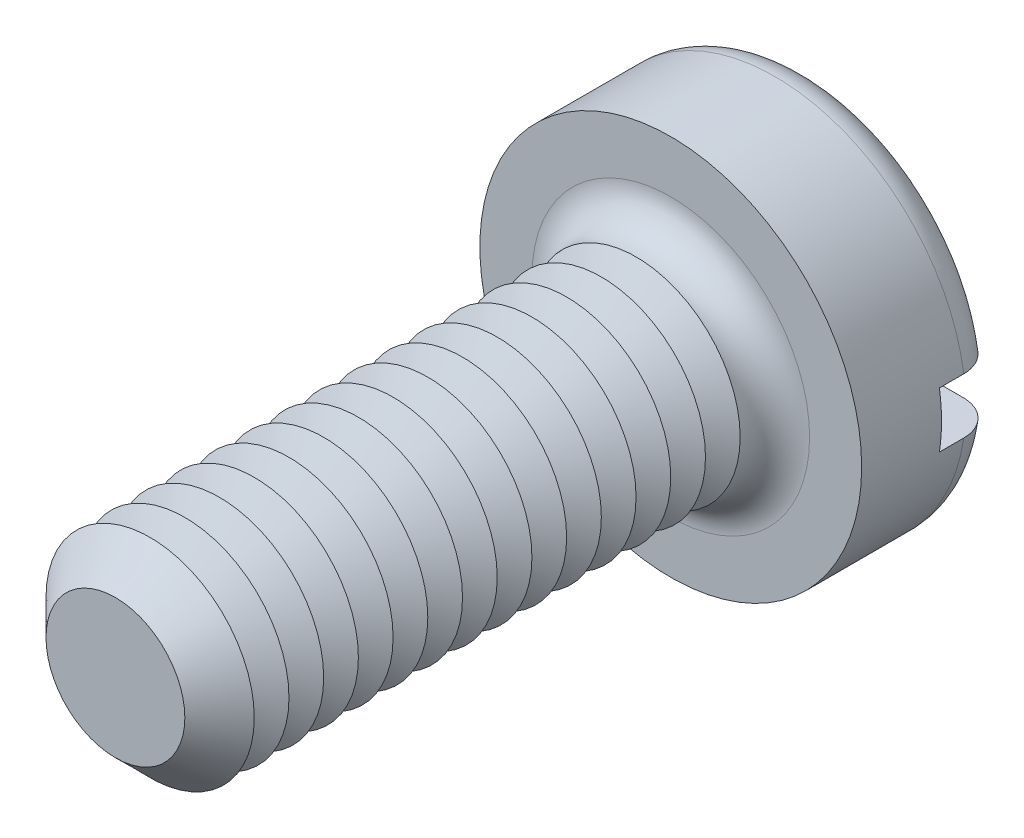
ISO-10303-21;
HEADER;
FILE_DESCRIPTION(('STEP AP214'),'2;1');
FILE_NAME('part.step','',(''),(''),'','','');
FILE_SCHEMA(('AUTOMOTIVE_DESIGN { 1 0 10303 214 1 1 1 1 }'));
ENDSEC;
DATA;
#1=APPLICATION_CONTEXT('core data for automotive mechanical design processes');
#2=APPLICATION_PROTOCOL_DEFINITION('international standard','automotive_design',2000,#1);
#3=PRODUCT_CONTEXT('',#1,'mechanical');
#4=PRODUCT('Part','Part','',(#3));
#5=PRODUCT_RELATED_PRODUCT_CATEGORY('part','',(#4));
#6=PRODUCT_DEFINITION_FORMATION('','',#4);
#7=PRODUCT_DEFINITION_CONTEXT('part definition',#1,'design');
#8=PRODUCT_DEFINITION('design','',#6,#7);
#9=PRODUCT_DEFINITION_SHAPE('','',#8);
#10=(LENGTH_UNIT() NAMED_UNIT(*) SI_UNIT(.MILLI.,.METRE.));
#11=(NAMED_UNIT(*) PLANE_ANGLE_UNIT() SI_UNIT($,.RADIAN.));
#12=(NAMED_UNIT(*) SI_UNIT($,.STERADIAN.) SOLID_ANGLE_UNIT());
#13=UNCERTAINTY_MEASURE_WITH_UNIT(LENGTH_MEASURE(1.E-05),#10,'distance_accuracy_value','');
#14=(GEOMETRIC_REPRESENTATION_CONTEXT(3) GLOBAL_UNCERTAINTY_ASSIGNED_CONTEXT((#13)) GLOBAL_UNIT_ASSIGNED_CONTEXT((#10,
#11,#12)) REPRESENTATION_CONTEXT('',''));
#15=CARTESIAN_POINT('',(0.,0.,0.));
#16=DIRECTION('',(0.,0.,1.));
#17=DIRECTION('',(1.,0.,0.));
#18=AXIS2_PLACEMENT_3D('',#15,#16,#17);
#19=CARTESIAN_POINT('',(0.,0.,-2.));
#20=DIRECTION('',(0.,0.,1.));
#21=DIRECTION('',(1.,0.,0.));
#22=AXIS2_PLACEMENT_3D('',#19,#20,#21);
#23=PLANE('',#22);
#24=CARTESIAN_POINT('',(0.,0.,-2.));
#25=DIRECTION('',(0.,0.,1.));
#26=DIRECTION('',(1.,0.,0.));
#27=AXIS2_PLACEMENT_3D('',#24,#25,#26);
#28=CIRCLE('',#27,2.25);
#29=CARTESIAN_POINT('',(-2.21415898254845,0.4,-2.));
#30=VERTEX_POINT('',#29);
#31=CARTESIAN_POINT('',(2.21415898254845,0.4,-2.));
#32=VERTEX_POINT('',#31);
#33=EDGE_CURVE('E116',#30,#32,#28,.F.);
#34=ORIENTED_EDGE('',*,*,#33,.T.);
#35=DIRECTION('',(1.,0.,0.));
#36=VECTOR('',#35,1.);
#37=CARTESIAN_POINT('',(-2.75,0.400000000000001,-2.));
#38=LINE('',#37,#36);
#39=EDGE_CURVE('E111',#30,#32,#38,.T.);
#40=ORIENTED_EDGE('',*,*,#39,.F.);
#41=EDGE_LOOP('',(#34,#40));
#42=FACE_BOUND('',#41,.T.);
#43=ADVANCED_FACE('F39',(#42),#23,.F.);
#44=CARTESIAN_POINT('',(0.,0.,-1.5));
#45=DIRECTION('',(0.,0.,1.));
#46=DIRECTION('',(1.,0.,0.));
#47=AXIS2_PLACEMENT_3D('',#44,#45,#46);
#48=TOROIDAL_SURFACE('',#47,2.25,0.5);
#49=CARTESIAN_POINT('',(-2.6296588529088,0.400000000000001,-1.78631483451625));
#50=CARTESIAN_POINT('',(-2.61332846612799,0.400000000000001,-1.80942627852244));
#51=CARTESIAN_POINT('',(-2.59501593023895,0.400000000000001,-1.83116426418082));
#52=CARTESIAN_POINT('',(-2.55497423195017,0.400000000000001,-1.87126271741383));
#53=CARTESIAN_POINT('',(-2.53324055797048,0.4,-1.88961865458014));
#54=CARTESIAN_POINT('',(-2.48702796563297,0.4,-1.92241505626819));
#55=CARTESIAN_POINT('',(-2.46255183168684,0.4,-1.93685944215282));
#56=CARTESIAN_POINT('',(-2.41154731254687,0.4,-1.96147315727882));
#57=CARTESIAN_POINT('',(-2.38501943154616,0.4,-1.97164353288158));
#58=CARTESIAN_POINT('',(-2.3303912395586,0.4,-1.98753780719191));
#59=CARTESIAN_POINT('',(-2.30227842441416,0.4,-1.99321871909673));
#60=CARTESIAN_POINT('',(-2.24549884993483,0.4,-1.99984170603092));
#61=CARTESIAN_POINT('',(-2.21683202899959,0.4,-2.00078325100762));
#62=CARTESIAN_POINT('',(-2.15939326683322,0.4,-1.99790249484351));
#63=CARTESIAN_POINT('',(-2.13062419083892,0.4,-1.99402290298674));
#64=CARTESIAN_POINT('',(-2.07413526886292,0.4,-1.98151915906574));
#65=CARTESIAN_POINT('',(-2.04641547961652,0.4,-1.97289475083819));
#66=CARTESIAN_POINT('',(-1.99264697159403,0.4,-1.95107177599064));
#67=CARTESIAN_POINT('',(-1.96660904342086,0.4,-1.93784659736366));
#68=CARTESIAN_POINT('',(-1.91713954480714,0.4,-1.90718730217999));
#69=CARTESIAN_POINT('',(-1.89370795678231,0.4,-1.88975321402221));
#70=CARTESIAN_POINT('',(-1.85029144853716,0.4,-1.85126548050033));
#71=CARTESIAN_POINT('',(-1.83028607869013,0.4,-1.83023492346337));
#72=CARTESIAN_POINT('',(-1.79417432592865,0.4,-1.78505552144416));
#73=CARTESIAN_POINT('',(-1.77806752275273,0.4,-1.76090701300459));
#74=CARTESIAN_POINT('',(-1.75056079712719,0.4,-1.71067721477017));
#75=CARTESIAN_POINT('',(-1.7390748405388,0.4,-1.68464306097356));
#76=CARTESIAN_POINT('',(-1.72075680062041,0.4,-1.63098625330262));
#77=CARTESIAN_POINT('',(-1.71392397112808,0.4,-1.60336385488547));
#78=CARTESIAN_POINT('',(-1.70525661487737,0.4,-1.54801066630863));
#79=CARTESIAN_POINT('',(-1.70330866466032,0.4,-1.52029759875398));
#80=CARTESIAN_POINT('',(-1.70414820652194,0.4,-1.46494458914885));
#81=CARTESIAN_POINT('',(-1.70693532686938,0.4,-1.43730464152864));
#82=CARTESIAN_POINT('',(-1.71709335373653,0.4,-1.38318389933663));
#83=CARTESIAN_POINT('',(-1.72441580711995,0.4,-1.35669397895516));
#84=CARTESIAN_POINT('',(-1.74335830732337,0.4,-1.30529964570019));
#85=CARTESIAN_POINT('',(-1.75497853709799,0.4,-1.2803953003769));
#86=CARTESIAN_POINT('',(-1.78229453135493,0.4,-1.23258298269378));
#87=CARTESIAN_POINT('',(-1.79803217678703,0.4,-1.20969896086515));
#88=CARTESIAN_POINT('',(-1.83304498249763,0.4,-1.16682064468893));
#89=CARTESIAN_POINT('',(-1.85232054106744,0.4,-1.1468266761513));
#90=CARTESIAN_POINT('',(-1.89433695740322,0.4,-1.10980713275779));
#91=CARTESIAN_POINT('',(-1.91714740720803,0.4,-1.09286053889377));
#92=CARTESIAN_POINT('',(-1.96524407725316,0.4,-1.06294809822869));
#93=CARTESIAN_POINT('',(-1.99053056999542,0.4,-1.04998269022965));
#94=CARTESIAN_POINT('',(-2.04340612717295,0.4,-1.02814800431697));
#95=CARTESIAN_POINT('',(-2.07103098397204,0.4,-1.01936532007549));
#96=CARTESIAN_POINT('',(-2.12735840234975,0.4,-1.00652373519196));
#97=CARTESIAN_POINT('',(-2.15606102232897,0.4,-1.00246509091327));
#98=CARTESIAN_POINT('',(-2.21395379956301,0.4,-0.999181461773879));
#99=CARTESIAN_POINT('',(-2.24314598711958,0.4,-0.999992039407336));
#100=CARTESIAN_POINT('',(-2.30097585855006,0.4,-1.00652779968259));
#101=CARTESIAN_POINT('',(-2.32961355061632,0.4,-1.01225290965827));
#102=CARTESIAN_POINT('',(-2.38536238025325,0.4,-1.02843951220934));
#103=CARTESIAN_POINT('',(-2.41248047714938,0.4,-1.03887701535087));
#104=CARTESIAN_POINT('',(-2.46454860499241,0.4,-1.06421009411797));
#105=CARTESIAN_POINT('',(-2.48949875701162,0.4,-1.0791054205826));
#106=CARTESIAN_POINT('',(-2.53620471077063,0.4,-1.11274531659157));
#107=CARTESIAN_POINT('',(-2.55799482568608,0.400000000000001,-1.1314422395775));
#108=CARTESIAN_POINT('',(-2.59807595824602,0.400000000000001,-1.17227176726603));
#109=CARTESIAN_POINT('',(-2.6163672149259,0.400000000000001,-1.19440413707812));
#110=CARTESIAN_POINT('',(-2.64868581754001,0.400000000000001,-1.24117072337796));
#111=CARTESIAN_POINT('',(-2.66276466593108,0.400000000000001,-1.26576935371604));
#112=CARTESIAN_POINT('',(-2.68654482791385,0.400000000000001,-1.31699754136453));
#113=CARTESIAN_POINT('',(-2.69624657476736,0.400000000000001,-1.34362689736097));
#114=CARTESIAN_POINT('',(-2.71090527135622,0.400000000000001,-1.39787706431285));
#115=CARTESIAN_POINT('',(-2.71590826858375,0.400000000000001,-1.4254854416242));
#116=CARTESIAN_POINT('',(-2.72118463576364,0.400000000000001,-1.48115803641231));
#117=CARTESIAN_POINT('',(-2.72145696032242,0.400000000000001,-1.50922235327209));
#118=CARTESIAN_POINT('',(-2.71727180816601,0.400000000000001,-1.56487271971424));
#119=CARTESIAN_POINT('',(-2.71283440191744,0.400000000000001,-1.59246029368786));
#120=CARTESIAN_POINT('',(-2.69939521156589,0.400000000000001,-1.64647499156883));
#121=CARTESIAN_POINT('',(-2.69039909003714,0.400000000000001,-1.67290351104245));
#122=CARTESIAN_POINT('',(-2.67251693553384,0.400000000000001,-1.71382731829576));
#123=CARTESIAN_POINT('',(-2.66497994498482,0.400000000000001,-1.72892686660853));
#124=CARTESIAN_POINT('',(-2.64841616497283,0.400000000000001,-1.75828509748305));
#125=CARTESIAN_POINT('',(-2.63938938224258,0.400000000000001,-1.77254378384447));
#126=CARTESIAN_POINT('',(-2.6296588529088,0.400000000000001,-1.78631483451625));
#127=B_SPLINE_CURVE_WITH_KNOTS('',3,(#49,#50,#51,#52,#53,#54,#55,#56,#57,#58,#59,#60,#61,#62,
#63,#64,#65,#66,#67,#68,#69,#70,#71,#72,#73,#74,#75,#76,#77,#78,#79,#80,#81,#82,#83,#84,#85,#86,
#87,#88,#89,#90,#91,#92,#93,#94,#95,#96,#97,#98,#99,#100,#101,#102,#103,#104,#105,#106,#107,
#108,#109,#110,#111,#112,#113,#114,#115,#116,#117,#118,#119,#120,#121,#122,#123,#124,#125,#126),
.UNSPECIFIED.,.T.,.F.,(4,2,2,2,2,2,2,2,2,2,2,2,2,2,2,2,2,2,2,2,2,2,2,2,2,2,2,2,2,2,2,2,2,2,2,2,
2,2,4),(0.,0.0848338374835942,0.16978050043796,0.254641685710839,0.339482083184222,
0.42512530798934,0.510778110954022,0.597458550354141,0.684143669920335,0.771338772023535,
0.858533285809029,0.945187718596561,1.03183280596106,1.11678035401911,1.20171427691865,
1.28465703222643,1.36759327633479,1.4496584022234,1.53172702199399,1.61466526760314,
1.69761285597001,1.78247103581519,1.86733856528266,1.95389396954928,2.0404540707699,
2.12764713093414,2.21483890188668,2.30159172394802,2.38833969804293,2.4740609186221,
2.55977628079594,2.6443962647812,2.72900787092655,2.81278135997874,2.89657336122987,
2.98000971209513,3.06334267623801,3.113891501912,3.16444009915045),.UNSPECIFIED.);
#128=CARTESIAN_POINT('',(-2.72075357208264,0.400000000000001,-1.50000000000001));
#129=VERTEX_POINT('',#128);
#130=EDGE_CURVE('E290',#129,#30,#127,.T.);
#131=ORIENTED_EDGE('',*,*,#130,.F.);
#132=CARTESIAN_POINT('',(0.,0.,-1.5));
#133=DIRECTION('',(0.,0.,1.));
#134=DIRECTION('',(1.,0.,0.));
#135=AXIS2_PLACEMENT_3D('',#132,#133,#134);
#136=CIRCLE('',#135,2.75);
#137=CARTESIAN_POINT('',(2.7207535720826,0.4,-1.5));
#138=VERTEX_POINT('',#137);
#139=EDGE_CURVE('E124',#138,#129,#136,.T.);
#140=ORIENTED_EDGE('',*,*,#139,.F.);
#141=CARTESIAN_POINT('',(1.7362507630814,0.4,-1.6752840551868));
#142=CARTESIAN_POINT('',(1.74636083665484,0.4,-1.70159961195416));
#143=CARTESIAN_POINT('',(1.7587429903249,0.4,-1.72706707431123));
#144=CARTESIAN_POINT('',(1.78764414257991,0.4,-1.77556609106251));
#145=CARTESIAN_POINT('',(1.80416918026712,0.4,-1.79859401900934));
#146=CARTESIAN_POINT('',(1.84080454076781,0.4,-1.84153587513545));
#147=CARTESIAN_POINT('',(1.86090949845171,0.4,-1.86145438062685));
#148=CARTESIAN_POINT('',(1.9041208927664,0.4,-1.89769607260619));
#149=CARTESIAN_POINT('',(1.92722659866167,0.4,-1.91402013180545));
#150=CARTESIAN_POINT('',(1.97620958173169,0.4,-1.94291288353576));
#151=CARTESIAN_POINT('',(2.00212726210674,0.4,-1.95541309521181));
#152=CARTESIAN_POINT('',(2.05567603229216,0.4,-1.97595143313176));
#153=CARTESIAN_POINT('',(2.08330733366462,0.4,-1.98398900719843));
#154=CARTESIAN_POINT('',(2.13989163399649,0.4,-1.99545904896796));
#155=CARTESIAN_POINT('',(2.16885726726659,0.4,-1.99882930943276));
#156=CARTESIAN_POINT('',(2.22694412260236,0.4,-2.00065872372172));
#157=CARTESIAN_POINT('',(2.25606534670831,0.4,-1.99911781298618));
#158=CARTESIAN_POINT('',(2.31362436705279,0.4,-1.99114818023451));
#159=CARTESIAN_POINT('',(2.34206235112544,0.4,-1.98472081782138));
#160=CARTESIAN_POINT('',(2.39743709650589,0.4,-1.96713601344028));
#161=CARTESIAN_POINT('',(2.42437392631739,0.4,-1.95597878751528));
#162=CARTESIAN_POINT('',(2.47569769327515,0.4,-1.92935960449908));
#163=CARTESIAN_POINT('',(2.50010686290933,0.4,-1.91394052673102));
#164=CARTESIAN_POINT('',(2.54594525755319,0.4,-1.8791725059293));
#165=CARTESIAN_POINT('',(2.56737468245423,0.4,-1.85982382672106));
#166=CARTESIAN_POINT('',(2.60634898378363,0.4,-1.81801641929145));
#167=CARTESIAN_POINT('',(2.6239407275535,0.4,-1.79560138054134));
#168=CARTESIAN_POINT('',(2.65505953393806,0.4,-1.7481077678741));
#169=CARTESIAN_POINT('',(2.66858686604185,0.4,-1.72302937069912));
#170=CARTESIAN_POINT('',(2.69103536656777,0.4,-1.67123055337));
#171=CARTESIAN_POINT('',(2.70000740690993,0.4,-1.64453217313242));
#172=CARTESIAN_POINT('',(2.71330608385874,0.4,-1.59000262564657));
#173=CARTESIAN_POINT('',(2.71763293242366,0.4,-1.5621715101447));
#174=CARTESIAN_POINT('',(2.72149675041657,0.4,-1.50637655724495));
#175=CARTESIAN_POINT('',(2.72106725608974,0.4,-1.47841503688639));
#176=CARTESIAN_POINT('',(2.7155123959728,0.4,-1.42296287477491));
#177=CARTESIAN_POINT('',(2.71038711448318,0.4,-1.39547222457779));
#178=CARTESIAN_POINT('',(2.69560462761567,0.4,-1.34178071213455));
#179=CARTESIAN_POINT('',(2.68595389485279,0.4,-1.31557806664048));
#180=CARTESIAN_POINT('',(2.66240876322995,0.4,-1.26515516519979));
#181=CARTESIAN_POINT('',(2.64851431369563,0.4,-1.24093493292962));
#182=CARTESIAN_POINT('',(2.61681930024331,0.4,-1.19504594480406));
#183=CARTESIAN_POINT('',(2.59900198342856,0.4,-1.17338876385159));
#184=CARTESIAN_POINT('',(2.56001495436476,0.4,-1.13333899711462));
#185=CARTESIAN_POINT('',(2.53884510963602,0.4,-1.11494654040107));
#186=CARTESIAN_POINT('',(2.49354554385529,0.4,-1.08175888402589));
#187=CARTESIAN_POINT('',(2.46938991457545,0.4,-1.06699905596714));
#188=CARTESIAN_POINT('',(2.41896725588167,0.4,-1.04168682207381));
#189=CARTESIAN_POINT('',(2.39270009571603,0.4,-1.03113467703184));
#190=CARTESIAN_POINT('',(2.33844927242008,0.4,-1.01439607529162));
#191=CARTESIAN_POINT('',(2.31044823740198,0.4,-1.00826592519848));
#192=CARTESIAN_POINT('',(2.25381752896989,0.4,-1.00073183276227));
#193=CARTESIAN_POINT('',(2.22518781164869,0.4,-0.999328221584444));
#194=CARTESIAN_POINT('',(2.16774231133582,0.4,-1.00127811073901));
#195=CARTESIAN_POINT('',(2.13892848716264,0.4,-1.00468955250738));
#196=CARTESIAN_POINT('',(2.08227193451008,0.4,-1.01626887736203));
#197=CARTESIAN_POINT('',(2.05442926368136,0.4,-1.02443704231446));
#198=CARTESIAN_POINT('',(2.00032604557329,0.4,-1.04537295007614));
#199=CARTESIAN_POINT('',(1.97407661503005,0.4,-1.05816944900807));
#200=CARTESIAN_POINT('',(1.92411255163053,0.4,-1.08801035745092));
#201=CARTESIAN_POINT('',(1.90039792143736,0.4,-1.10505477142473));
#202=CARTESIAN_POINT('',(1.85633574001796,0.4,-1.14282887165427));
#203=CARTESIAN_POINT('',(1.83597040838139,0.4,-1.16353779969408));
#204=CARTESIAN_POINT('',(1.79908731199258,0.4,-1.20813793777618));
#205=CARTESIAN_POINT('',(1.78256899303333,0.4,-1.23202868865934));
#206=CARTESIAN_POINT('',(1.75420022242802,0.4,-1.28183173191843));
#207=CARTESIAN_POINT('',(1.74226635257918,0.4,-1.30769648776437));
#208=CARTESIAN_POINT('',(1.72302798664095,0.4,-1.36110211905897));
#209=CARTESIAN_POINT('',(1.71572395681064,0.4,-1.38864316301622));
#210=CARTESIAN_POINT('',(1.70611974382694,0.4,-1.44392326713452));
#211=CARTESIAN_POINT('',(1.70370764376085,0.4,-1.47164298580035));
#212=CARTESIAN_POINT('',(1.70363822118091,0.4,-1.52706336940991));
#213=CARTESIAN_POINT('',(1.70597448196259,0.4,-1.55476400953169));
#214=CARTESIAN_POINT('',(1.71335146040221,0.4,-1.59796127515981));
#215=CARTESIAN_POINT('',(1.71686033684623,0.4,-1.61373520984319));
#216=CARTESIAN_POINT('',(1.7254146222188,0.4,-1.64486018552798));
#217=CARTESIAN_POINT('',(1.73045999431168,0.4,-1.66021123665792));
#218=CARTESIAN_POINT('',(1.7362507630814,0.4,-1.6752840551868));
#219=B_SPLINE_CURVE_WITH_KNOTS('',3,(#141,#142,#143,#144,#145,#146,#147,#148,#149,#150,#151,
#152,#153,#154,#155,#156,#157,#158,#159,#160,#161,#162,#163,#164,#165,#166,#167,#168,#169,#170,
#171,#172,#173,#174,#175,#176,#177,#178,#179,#180,#181,#182,#183,#184,#185,#186,#187,#188,#189,
#190,#191,#192,#193,#194,#195,#196,#197,#198,#199,#200,#201,#202,#203,#204,#205,#206,#207,#208,
#209,#210,#211,#212,#213,#214,#215,#216,#217,#218),.UNSPECIFIED.,.T.,.F.,(4,2,2,2,2,2,2,2,2,2,2,
2,2,2,2,2,2,2,2,2,2,2,2,2,2,2,2,2,2,2,2,2,2,2,2,2,2,2,4),(0.,0.0845117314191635,
0.169147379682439,0.253657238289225,0.338146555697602,0.424070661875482,0.510005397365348,
0.597074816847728,0.684145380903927,0.771191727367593,0.858234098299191,0.94443074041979,
1.03062159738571,1.11569223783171,1.20075723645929,1.28485012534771,1.36893917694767,
1.45243570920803,1.53593074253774,1.61930671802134,1.70268368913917,1.7864238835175,
1.87016738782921,1.95469664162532,2.03923113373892,2.12482389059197,2.21042264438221,
2.29706026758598,2.38370302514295,2.47089361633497,2.55808429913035,2.64479602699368,
2.73149525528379,2.81653234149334,2.9015779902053,2.98465497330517,3.06761976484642,
3.11602689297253,3.164432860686),.UNSPECIFIED.);
#220=EDGE_CURVE('E292',#32,#138,#219,.T.);
#221=ORIENTED_EDGE('',*,*,#220,.F.);
#222=ORIENTED_EDGE('',*,*,#33,.F.);
#223=EDGE_LOOP('',(#131,#140,#221,#222));
#224=FACE_BOUND('',#223,.T.);
#225=ADVANCED_FACE('F274',(#224),#48,.T.);
#226=CARTESIAN_POINT('',(0.,0.,-2.));
#227=DIRECTION('',(0.,0.,1.));
#228=DIRECTION('',(1.,0.,0.));
#229=AXIS2_PLACEMENT_3D('',#226,#227,#228);
#230=CYLINDRICAL_SURFACE('',#229,2.75);
#231=DIRECTION('',(0.,0.,1.));
#232=VECTOR('',#231,1.);
#233=CARTESIAN_POINT('',(2.72075357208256,0.4,-2.));
#234=LINE('',#233,#232);
#235=CARTESIAN_POINT('',(2.72075357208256,0.4,-1.15));
#236=VERTEX_POINT('',#235);
#237=EDGE_CURVE('E307',#138,#236,#234,.T.);
#238=ORIENTED_EDGE('',*,*,#237,.F.);
#239=ORIENTED_EDGE('',*,*,#139,.T.);
#240=DIRECTION('',(0.,0.,1.));
#241=VECTOR('',#240,1.);
#242=CARTESIAN_POINT('',(-2.72075357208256,0.4,-2.));
#243=LINE('',#242,#241);
#244=CARTESIAN_POINT('',(-2.72075357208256,0.4,-1.15));
#245=VERTEX_POINT('',#244);
#246=EDGE_CURVE('E63',#245,#129,#243,.F.);
#247=ORIENTED_EDGE('',*,*,#246,.F.);
#248=CARTESIAN_POINT('',(0.,0.,-1.15));
#249=DIRECTION('',(0.,0.,-1.));
#250=DIRECTION('',(-1.,0.,0.));
#251=AXIS2_PLACEMENT_3D('',#248,#249,#250);
#252=CIRCLE('',#251,2.75);
#253=CARTESIAN_POINT('',(-2.72075357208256,-0.4,-1.15));
#254=VERTEX_POINT('',#253);
#255=EDGE_CURVE('E43',#245,#254,#252,.F.);
#256=ORIENTED_EDGE('',*,*,#255,.T.);
#257=DIRECTION('',(0.,0.,1.));
#258=VECTOR('',#257,1.);
#259=CARTESIAN_POINT('',(-2.72075357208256,-0.4,-2.));
#260=LINE('',#259,#258);
#261=CARTESIAN_POINT('',(-2.72075357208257,-0.4,-1.5));
#262=VERTEX_POINT('',#261);
#263=EDGE_CURVE('E304',#262,#254,#260,.T.);
#264=ORIENTED_EDGE('',*,*,#263,.F.);
#265=CARTESIAN_POINT('',(2.72075357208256,-0.4,-1.5));
#266=VERTEX_POINT('',#265);
#267=EDGE_CURVE('E126',#262,#266,#136,.T.);
#268=ORIENTED_EDGE('',*,*,#267,.T.);
#269=DIRECTION('',(0.,0.,1.));
#270=VECTOR('',#269,1.);
#271=CARTESIAN_POINT('',(2.72075357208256,-0.4,-2.));
#272=LINE('',#271,#270);
#273=CARTESIAN_POINT('',(2.72075357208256,-0.4,-1.15));
#274=VERTEX_POINT('',#273);
#275=EDGE_CURVE('E55',#274,#266,#272,.F.);
#276=ORIENTED_EDGE('',*,*,#275,.F.);
#277=EDGE_CURVE('E11',#274,#236,#252,.F.);
#278=ORIENTED_EDGE('',*,*,#277,.T.);
#279=EDGE_LOOP('',(#238,#239,#247,#256,#264,#268,#276,#278));
#280=FACE_BOUND('',#279,.T.);
#281=CARTESIAN_POINT('',(0.,0.,0.));
#282=DIRECTION('',(0.,0.,1.));
#283=DIRECTION('',(1.,0.,0.));
#284=AXIS2_PLACEMENT_3D('',#281,#282,#283);
#285=CIRCLE('',#284,2.75);
#286=CARTESIAN_POINT('',(2.75,0.,0.));
#287=VERTEX_POINT('',#286);
#288=EDGE_CURVE('E310',#287,#287,#285,.T.);
#289=ORIENTED_EDGE('',*,*,#288,.F.);
#290=EDGE_LOOP('',(#289));
#291=FACE_BOUND('',#290,.T.);
#292=ADVANCED_FACE('F270',(#280,#291),#230,.T.);
#293=CARTESIAN_POINT('',(2.21415898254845,-0.4,-2.));
#294=VERTEX_POINT('',#293);
#295=CARTESIAN_POINT('',(-2.21415898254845,-0.4,-2.));
#296=VERTEX_POINT('',#295);
#297=EDGE_CURVE('E109',#294,#296,#28,.F.);
#298=ORIENTED_EDGE('',*,*,#297,.T.);
#299=DIRECTION('',(-1.,0.,0.));
#300=VECTOR('',#299,1.);
#301=CARTESIAN_POINT('',(-2.75,-0.4,-2.));
#302=LINE('',#301,#300);
#303=EDGE_CURVE('E96',#294,#296,#302,.T.);
#304=ORIENTED_EDGE('',*,*,#303,.F.);
#305=EDGE_LOOP('',(#298,#304));
#306=FACE_BOUND('',#305,.T.);
#307=ADVANCED_FACE('F108',(#306),#23,.F.);
#308=CARTESIAN_POINT('',(0.,0.,0.));
#309=DIRECTION('',(0.,0.,1.));
#310=DIRECTION('',(1.,0.,0.));
#311=AXIS2_PLACEMENT_3D('',#308,#309,#310);
#312=PLANE('',#311);
#313=CARTESIAN_POINT('',(0.,0.,0.));
#314=DIRECTION('',(0.,0.,1.));
#315=DIRECTION('',(1.,0.,0.));
#316=AXIS2_PLACEMENT_3D('',#313,#314,#315);
#317=CIRCLE('',#316,2.);
#318=CARTESIAN_POINT('',(2.,0.,0.));
#319=VERTEX_POINT('',#318);
#320=EDGE_CURVE('E115',#319,#319,#317,.F.);
#321=ORIENTED_EDGE('',*,*,#320,.T.);
#322=EDGE_LOOP('',(#321));
#323=FACE_BOUND('',#322,.T.);
#324=ORIENTED_EDGE('',*,*,#288,.T.);
#325=EDGE_LOOP('',(#324));
#326=FACE_BOUND('',#325,.T.);
#327=ADVANCED_FACE('F269',(#323,#326),#312,.T.);
#328=CARTESIAN_POINT('',(-2.6296588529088,-0.4,-1.78631483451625));
#329=CARTESIAN_POINT('',(-2.64575286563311,-0.4,-1.76353353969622));
#330=CARTESIAN_POINT('',(-2.65994473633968,-0.4,-1.73938506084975));
#331=CARTESIAN_POINT('',(-2.68408879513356,-0.4,-1.68903091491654));
#332=CARTESIAN_POINT('',(-2.69403633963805,-0.4,-1.6628230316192));
#333=CARTESIAN_POINT('',(-2.70937899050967,-0.4,-1.60911025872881));
#334=CARTESIAN_POINT('',(-2.71477511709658,-0.4,-1.5816056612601));
#335=CARTESIAN_POINT('',(-2.72085365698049,-0.4,-1.52608718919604));
#336=CARTESIAN_POINT('',(-2.7215371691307,-0.4,-1.49807343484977));
#337=CARTESIAN_POINT('',(-2.71817903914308,-0.4,-1.44242333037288));
#338=CARTESIAN_POINT('',(-2.71415291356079,-0.4,-1.41478604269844));
#339=CARTESIAN_POINT('',(-2.70152104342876,-0.4,-1.36057835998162));
#340=CARTESIAN_POINT('',(-2.69291517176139,-0.4,-1.33400799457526));
#341=CARTESIAN_POINT('',(-2.67137052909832,-0.4,-1.28266198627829));
#342=CARTESIAN_POINT('',(-2.65842829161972,-0.4,-1.25788779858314));
#343=CARTESIAN_POINT('',(-2.62859348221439,-0.4,-1.21084577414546));
#344=CARTESIAN_POINT('',(-2.61170082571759,-0.4,-1.18857799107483));
#345=CARTESIAN_POINT('',(-2.5743351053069,-0.4,-1.1470221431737));
#346=CARTESIAN_POINT('',(-2.55383974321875,-0.4,-1.12775413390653));
#347=CARTESIAN_POINT('',(-2.5099353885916,-0.4,-1.09288845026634));
#348=CARTESIAN_POINT('',(-2.48652625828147,-0.4,-1.07729094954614));
#349=CARTESIAN_POINT('',(-2.43718903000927,-0.4,-1.0500239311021));
#350=CARTESIAN_POINT('',(-2.41123629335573,-0.4,-1.0383990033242));
#351=CARTESIAN_POINT('',(-2.35776417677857,-0.4,-1.01960886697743));
#352=CARTESIAN_POINT('',(-2.33024469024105,-0.4,-1.01244396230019));
#353=CARTESIAN_POINT('',(-2.27404134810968,-0.4,-1.00268156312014));
#354=CARTESIAN_POINT('',(-2.24534705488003,-0.4,-1.00014414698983));
#355=CARTESIAN_POINT('',(-2.18793513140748,-0.4,-0.999867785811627));
#356=CARTESIAN_POINT('',(-2.15921749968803,-0.4,-1.00212917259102));
#357=CARTESIAN_POINT('',(-2.10225052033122,-0.4,-1.01142552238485));
#358=CARTESIAN_POINT('',(-2.07400941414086,-0.4,-1.01851105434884));
#359=CARTESIAN_POINT('',(-2.01911044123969,-0.4,-1.03730994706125));
#360=CARTESIAN_POINT('',(-1.99245264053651,-0.4,-1.04902350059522));
#361=CARTESIAN_POINT('',(-1.94142108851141,-0.4,-1.07679847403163));
#362=CARTESIAN_POINT('',(-1.91705303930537,-0.4,-1.09287038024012));
#363=CARTESIAN_POINT('',(-1.87139758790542,-0.4,-1.12891897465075));
#364=CARTESIAN_POINT('',(-1.85011007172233,-0.4,-1.14889551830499));
#365=CARTESIAN_POINT('',(-1.81149058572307,-0.4,-1.19196940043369));
#366=CARTESIAN_POINT('',(-1.79411779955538,-0.4,-1.21503011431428));
#367=CARTESIAN_POINT('',(-1.76359546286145,-0.4,-1.26379588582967));
#368=CARTESIAN_POINT('',(-1.75044532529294,-0.4,-1.28950057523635));
#369=CARTESIAN_POINT('',(-1.72906221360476,-0.4,-1.3422057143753));
#370=CARTESIAN_POINT('',(-1.72072512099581,-0.4,-1.3691639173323));
#371=CARTESIAN_POINT('',(-1.70880448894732,-0.4,-1.42411084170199));
#372=CARTESIAN_POINT('',(-1.7052202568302,-0.4,-1.45209941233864));
#373=CARTESIAN_POINT('',(-1.70295553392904,-0.4,-1.50768522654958));
#374=CARTESIAN_POINT('',(-1.70417398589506,-0.4,-1.53527840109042));
#375=CARTESIAN_POINT('',(-1.71124536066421,-0.4,-1.58986292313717));
#376=CARTESIAN_POINT('',(-1.71709811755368,-0.4,-1.61685429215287));
#377=CARTESIAN_POINT('',(-1.73321132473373,-0.4,-1.66938107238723));
#378=CARTESIAN_POINT('',(-1.74345625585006,-0.4,-1.69492125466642));
#379=CARTESIAN_POINT('',(-1.76802111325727,-0.4,-1.74395877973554));
#380=CARTESIAN_POINT('',(-1.78234133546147,-0.4,-1.76745597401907));
#381=CARTESIAN_POINT('',(-1.81488631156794,-0.4,-1.81216193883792));
#382=CARTESIAN_POINT('',(-1.83317116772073,-0.4,-1.83332693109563));
#383=CARTESIAN_POINT('',(-1.87296030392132,-0.4,-1.872375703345));
#384=CARTESIAN_POINT('',(-1.89446497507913,-0.4,-1.89025908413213));
#385=CARTESIAN_POINT('',(-1.94063077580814,-0.4,-1.92267732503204));
#386=CARTESIAN_POINT('',(-1.96535444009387,-0.4,-1.93712316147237));
#387=CARTESIAN_POINT('',(-2.01684705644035,-0.4,-1.96173690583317));
#388=CARTESIAN_POINT('',(-2.04361620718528,-0.4,-1.97190439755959));
#389=CARTESIAN_POINT('',(-2.09891021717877,-0.4,-1.9878230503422));
#390=CARTESIAN_POINT('',(-2.12745653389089,-0.4,-1.99349978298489));
#391=CARTESIAN_POINT('',(-2.18509639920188,-0.4,-1.99999556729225));
#392=CARTESIAN_POINT('',(-2.21418994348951,-0.4,-2.00081465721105));
#393=CARTESIAN_POINT('',(-2.27218032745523,-0.4,-1.99755156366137));
#394=CARTESIAN_POINT('',(-2.30107643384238,-0.4,-1.99345627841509));
#395=CARTESIAN_POINT('',(-2.35776697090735,-0.4,-1.98043125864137));
#396=CARTESIAN_POINT('',(-2.38556116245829,-0.4,-1.97150048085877));
#397=CARTESIAN_POINT('',(-2.43901832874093,-0.4,-1.94912081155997));
#398=CARTESIAN_POINT('',(-2.46469578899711,-0.4,-1.93570648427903));
#399=CARTESIAN_POINT('',(-2.51337022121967,-0.4,-1.90471183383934));
#400=CARTESIAN_POINT('',(-2.53637056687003,-0.4,-1.88713684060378));
#401=CARTESIAN_POINT('',(-2.57111030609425,-0.4,-1.85552084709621));
#402=CARTESIAN_POINT('',(-2.58386709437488,-0.4,-1.84257896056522));
#403=CARTESIAN_POINT('',(-2.60790410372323,-0.4,-1.81538935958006));
#404=CARTESIAN_POINT('',(-2.61918433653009,-0.4,-1.80114165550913));
#405=CARTESIAN_POINT('',(-2.6296588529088,-0.4,-1.78631483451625));
#406=B_SPLINE_CURVE_WITH_KNOTS('',3,(#328,#329,#330,#331,#332,#333,#334,#335,#336,#337,#338,
#339,#340,#341,#342,#343,#344,#345,#346,#347,#348,#349,#350,#351,#352,#353,#354,#355,#356,#357,
#358,#359,#360,#361,#362,#363,#364,#365,#366,#367,#368,#369,#370,#371,#372,#373,#374,#375,#376,
#377,#378,#379,#380,#381,#382,#383,#384,#385,#386,#387,#388,#389,#390,#391,#392,#393,#394,#395,
#396,#397,#398,#399,#400,#401,#402,#403,#404,#405),.UNSPECIFIED.,.T.,.F.,(4,2,2,2,2,2,2,2,2,2,2,
2,2,2,2,2,2,2,2,2,2,2,2,2,2,2,2,2,2,2,2,2,2,2,2,2,2,2,4),(0.,0.0836125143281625,
0.167316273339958,0.251001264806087,0.334666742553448,0.418057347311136,0.501450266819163,
0.584910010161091,0.668371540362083,0.752369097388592,0.836370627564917,0.921286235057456,
1.00620762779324,1.09222390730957,1.17824613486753,1.26518425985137,1.35212600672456,
1.43927882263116,1.52642841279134,1.61262232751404,1.69880425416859,1.7830443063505,
1.86727208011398,1.9497371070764,2.03219918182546,2.1143722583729,2.19655130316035,
2.28007615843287,2.36361116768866,2.44911836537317,2.53463387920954,2.62153862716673,
2.70844269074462,2.79557895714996,2.88273403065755,2.96923214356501,3.05562004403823,
3.11003826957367,3.16445606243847),.UNSPECIFIED.);
#407=EDGE_CURVE('E103',#296,#262,#406,.T.);
#408=ORIENTED_EDGE('',*,*,#407,.F.);
#409=ORIENTED_EDGE('',*,*,#297,.F.);
#410=CARTESIAN_POINT('',(1.7362507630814,-0.4,-1.6752840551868));
#411=CARTESIAN_POINT('',(1.72641416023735,-0.4,-1.64967314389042));
#412=CARTESIAN_POINT('',(1.71871480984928,-0.4,-1.62322216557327));
#413=CARTESIAN_POINT('',(1.70786038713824,-0.4,-1.56938399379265));
#414=CARTESIAN_POINT('',(1.70470970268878,-0.4,-1.54199592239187));
#415=CARTESIAN_POINT('',(1.70306971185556,-0.4,-1.48708393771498));
#416=CARTESIAN_POINT('',(1.70457942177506,-0.4,-1.45956005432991));
#417=CARTESIAN_POINT('',(1.71220670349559,-0.4,-1.40516538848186));
#418=CARTESIAN_POINT('',(1.71832341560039,-0.4,-1.3782944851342));
#419=CARTESIAN_POINT('',(1.73494792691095,-0.4,-1.32598312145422));
#420=CARTESIAN_POINT('',(1.74545076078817,-0.4,-1.30054108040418));
#421=CARTESIAN_POINT('',(1.77051013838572,-0.4,-1.25173932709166));
#422=CARTESIAN_POINT('',(1.7850670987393,-0.4,-1.22837982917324));
#423=CARTESIAN_POINT('',(1.81806903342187,-0.4,-1.1839775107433));
#424=CARTESIAN_POINT('',(1.8365752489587,-0.4,-1.16298023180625));
#425=CARTESIAN_POINT('',(1.87677669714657,-0.4,-1.1243010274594));
#426=CARTESIAN_POINT('',(1.89847230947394,-0.4,-1.10661949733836));
#427=CARTESIAN_POINT('',(1.94498854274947,-0.4,-1.07463966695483));
#428=CARTESIAN_POINT('',(1.96987078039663,-0.4,-1.06043095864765));
#429=CARTESIAN_POINT('',(2.02163980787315,-0.4,-1.0363161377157));
#430=CARTESIAN_POINT('',(2.04852678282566,-0.4,-1.02641042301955));
#431=CARTESIAN_POINT('',(2.10400319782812,-0.4,-1.01104128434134));
#432=CARTESIAN_POINT('',(2.13261287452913,-0.4,-1.00565079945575));
#433=CARTESIAN_POINT('',(2.19033179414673,-0.4,-0.999735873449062));
#434=CARTESIAN_POINT('',(2.2194410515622,-0.4,-0.999211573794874));
#435=CARTESIAN_POINT('',(2.27740442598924,-0.4,-1.00306591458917));
#436=CARTESIAN_POINT('',(2.30625777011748,-0.4,-1.00745623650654));
#437=CARTESIAN_POINT('',(2.36280530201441,-0.4,-1.02105937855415));
#438=CARTESIAN_POINT('',(2.39049952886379,-0.4,-1.03027203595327));
#439=CARTESIAN_POINT('',(2.44369359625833,-0.4,-1.05318710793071));
#440=CARTESIAN_POINT('',(2.46920965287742,-0.4,-1.0668518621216));
#441=CARTESIAN_POINT('',(2.51754507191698,-0.4,-1.09832423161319));
#442=CARTESIAN_POINT('',(2.54036461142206,-0.4,-1.11613157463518));
#443=CARTESIAN_POINT('',(2.58234752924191,-0.4,-1.15513986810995));
#444=CARTESIAN_POINT('',(2.601553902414,-0.4,-1.1762945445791));
#445=CARTESIAN_POINT('',(2.63609001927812,-0.4,-1.22156192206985));
#446=CARTESIAN_POINT('',(2.65142002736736,-0.4,-1.24567442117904));
#447=CARTESIAN_POINT('',(2.67757733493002,-0.4,-1.29585881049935));
#448=CARTESIAN_POINT('',(2.68845668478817,-0.4,-1.32190357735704));
#449=CARTESIAN_POINT('',(2.7056478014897,-0.4,-1.375459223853));
#450=CARTESIAN_POINT('',(2.71195980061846,-0.4,-1.40297002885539));
#451=CARTESIAN_POINT('',(2.71979288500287,-0.4,-1.45843707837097));
#452=CARTESIAN_POINT('',(2.72135241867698,-0.4,-1.48638789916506));
#453=CARTESIAN_POINT('',(2.71974298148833,-0.4,-1.54215266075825));
#454=CARTESIAN_POINT('',(2.71657412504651,-0.4,-1.56996660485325));
#455=CARTESIAN_POINT('',(2.70561779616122,-0.4,-1.62459191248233));
#456=CARTESIAN_POINT('',(2.69784258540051,-0.4,-1.65140573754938));
#457=CARTESIAN_POINT('',(2.6779146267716,-0.4,-1.70335337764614));
#458=CARTESIAN_POINT('',(2.66576185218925,-0.4,-1.72848718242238));
#459=CARTESIAN_POINT('',(2.63739107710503,-0.4,-1.77645196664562));
#460=CARTESIAN_POINT('',(2.62116029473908,-0.4,-1.79927538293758));
#461=CARTESIAN_POINT('',(2.58512700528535,-0.4,-1.84190182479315));
#462=CARTESIAN_POINT('',(2.56532438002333,-0.4,-1.86170475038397));
#463=CARTESIAN_POINT('',(2.522535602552,-0.4,-1.89791219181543));
#464=CARTESIAN_POINT('',(2.49952399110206,-0.4,-1.91428661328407));
#465=CARTESIAN_POINT('',(2.45110500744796,-0.4,-1.94299324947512));
#466=CARTESIAN_POINT('',(2.4256974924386,-0.4,-1.95532522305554));
#467=CARTESIAN_POINT('',(2.37288090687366,-0.4,-1.97575769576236));
#468=CARTESIAN_POINT('',(2.34545135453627,-0.4,-1.98380524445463));
#469=CARTESIAN_POINT('',(2.28963821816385,-0.4,-1.99524443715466));
#470=CARTESIAN_POINT('',(2.26125456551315,-0.4,-1.99863574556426));
#471=CARTESIAN_POINT('',(2.20395671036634,-0.4,-2.00070487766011));
#472=CARTESIAN_POINT('',(2.17504033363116,-0.4,-1.99932265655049));
#473=CARTESIAN_POINT('',(2.11784130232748,-0.4,-1.9917648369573));
#474=CARTESIAN_POINT('',(2.08955866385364,-0.4,-1.98558911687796));
#475=CARTESIAN_POINT('',(2.03419451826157,-0.4,-1.96854979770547));
#476=CARTESIAN_POINT('',(2.00712437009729,-0.4,-1.95764925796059));
#477=CARTESIAN_POINT('',(1.95519572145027,-0.4,-1.93144413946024));
#478=CARTESIAN_POINT('',(1.93033780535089,-0.4,-1.91613840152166));
#479=CARTESIAN_POINT('',(1.88362525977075,-0.4,-1.88157419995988));
#480=CARTESIAN_POINT('',(1.86176428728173,-0.4,-1.86232430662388));
#481=CARTESIAN_POINT('',(1.82167218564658,-0.4,-1.82038600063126));
#482=CARTESIAN_POINT('',(1.803436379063,-0.4,-1.7977020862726));
#483=CARTESIAN_POINT('',(1.77700088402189,-0.4,-1.7582526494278));
#484=CARTESIAN_POINT('',(1.7675549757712,-0.4,-1.74230781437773));
#485=CARTESIAN_POINT('',(1.75049861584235,-0.4,-1.70946415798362));
#486=CARTESIAN_POINT('',(1.7428881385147,-0.4,-1.69256534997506));
#487=CARTESIAN_POINT('',(1.7362507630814,-0.4,-1.6752840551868));
#488=B_SPLINE_CURVE_WITH_KNOTS('',3,(#410,#411,#412,#413,#414,#415,#416,#417,#418,#419,#420,
#421,#422,#423,#424,#425,#426,#427,#428,#429,#430,#431,#432,#433,#434,#435,#436,#437,#438,#439,
#440,#441,#442,#443,#444,#445,#446,#447,#448,#449,#450,#451,#452,#453,#454,#455,#456,#457,#458,
#459,#460,#461,#462,#463,#464,#465,#466,#467,#468,#469,#470,#471,#472,#473,#474,#475,#476,#477,
#478,#479,#480,#481,#482,#483,#484,#485,#486,#487),.UNSPECIFIED.,.T.,.F.,(4,2,2,2,2,2,2,2,2,2,2,
2,2,2,2,2,2,2,2,2,2,2,2,2,2,2,2,2,2,2,2,2,2,2,2,2,2,2,4),(0.,0.0822382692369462,
0.164555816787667,0.246855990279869,0.329140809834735,0.411332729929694,0.493533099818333,
0.577115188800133,0.660707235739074,0.746270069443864,0.831840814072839,0.918768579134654,
1.00569887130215,1.09283622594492,1.17997064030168,1.26638632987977,1.35279634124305,
1.43810213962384,1.52340211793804,1.60767384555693,1.69194128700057,1.77552515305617,
1.85910699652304,1.94246734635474,2.02582820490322,2.10945367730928,2.19308191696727,
2.2774160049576,2.36175512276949,2.4471137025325,2.53247843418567,2.61892083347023,
2.70536542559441,2.79249842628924,2.87965437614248,2.96662291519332,3.05347850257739,
3.10897061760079,3.16446195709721),.UNSPECIFIED.);
#489=EDGE_CURVE('E92',#266,#294,#488,.T.);
#490=ORIENTED_EDGE('',*,*,#489,.F.);
#491=ORIENTED_EDGE('',*,*,#267,.F.);
#492=EDGE_LOOP('',(#408,#409,#490,#491));
#493=FACE_BOUND('',#492,.T.);
#494=ADVANCED_FACE('F113',(#493),#48,.T.);
#495=CARTESIAN_POINT('',(0.,0.,0.5));
#496=DIRECTION('',(0.,0.,1.));
#497=DIRECTION('',(1.,0.,0.));
#498=AXIS2_PLACEMENT_3D('',#495,#496,#497);
#499=TOROIDAL_SURFACE('',#498,2.,0.5);
#500=ORIENTED_EDGE('',*,*,#320,.F.);
#501=EDGE_LOOP('',(#500));
#502=FACE_BOUND('',#501,.T.);
#503=CARTESIAN_POINT('',(0.,0.,0.5));
#504=DIRECTION('',(0.,0.,-1.));
#505=DIRECTION('',(-1.,0.,0.));
#506=AXIS2_PLACEMENT_3D('',#503,#504,#505);
#507=CIRCLE('',#506,1.5);
#508=CARTESIAN_POINT('',(-1.5,0.,0.5));
#509=VERTEX_POINT('',#508);
#510=EDGE_CURVE('E315',#509,#509,#507,.T.);
#511=ORIENTED_EDGE('',*,*,#510,.T.);
#512=EDGE_LOOP('',(#511));
#513=FACE_BOUND('',#512,.T.);
#514=ADVANCED_FACE('F262',(#502,#513),#499,.F.);
#515=CARTESIAN_POINT('',(0.,0.,0.750000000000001));
#516=DIRECTION('',(0.,0.,-1.));
#517=DIRECTION('',(-1.,0.,0.));
#518=AXIS2_PLACEMENT_3D('',#515,#516,#517);
#519=CONICAL_SURFACE('',#518,1.06698729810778,1.0471975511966);
#520=ORIENTED_EDGE('',*,*,#510,.F.);
#521=EDGE_LOOP('',(#520));
#522=FACE_BOUND('',#521,.T.);
#523=CARTESIAN_POINT('',(0.,0.,0.750000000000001));
#524=DIRECTION('',(0.,0.,-1.));
#525=DIRECTION('',(-1.,0.,0.));
#526=AXIS2_PLACEMENT_3D('',#523,#524,#525);
#527=CIRCLE('',#526,1.06698729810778);
#528=CARTESIAN_POINT('',(-1.06698729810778,0.,0.750000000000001));
#529=VERTEX_POINT('',#528);
#530=EDGE_CURVE('E320',#529,#529,#527,.T.);
#531=ORIENTED_EDGE('',*,*,#530,.T.);
#532=EDGE_LOOP('',(#531));
#533=FACE_BOUND('',#532,.T.);
#534=ADVANCED_FACE('F258',(#522,#533),#519,.T.);
#535=CARTESIAN_POINT('',(0.,0.,1.));
#536=DIRECTION('',(0.,0.,1.));
#537=DIRECTION('',(1.,0.,0.));
#538=AXIS2_PLACEMENT_3D('',#535,#536,#537);
#539=CONICAL_SURFACE('',#538,1.5,1.0471975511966);
#540=ORIENTED_EDGE('',*,*,#530,.F.);
#541=EDGE_LOOP('',(#540));
#542=FACE_BOUND('',#541,.T.);
#543=CARTESIAN_POINT('',(0.,0.,1.));
#544=DIRECTION('',(0.,0.,-1.));
#545=DIRECTION('',(-1.,0.,0.));
#546=AXIS2_PLACEMENT_3D('',#543,#544,#545);
#547=CIRCLE('',#546,1.5);
#548=CARTESIAN_POINT('',(-1.5,0.,1.));
#549=VERTEX_POINT('',#548);
#550=EDGE_CURVE('E326',#549,#549,#547,.T.);
#551=ORIENTED_EDGE('',*,*,#550,.T.);
#552=EDGE_LOOP('',(#551));
#553=FACE_BOUND('',#552,.T.);
#554=ADVANCED_FACE('F254',(#542,#553),#539,.T.);
#555=CARTESIAN_POINT('',(0.,0.,1.25));
#556=DIRECTION('',(0.,0.,-1.));
#557=DIRECTION('',(-1.,0.,0.));
#558=AXIS2_PLACEMENT_3D('',#555,#556,#557);
#559=CONICAL_SURFACE('',#558,1.06698729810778,1.0471975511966);
#560=ORIENTED_EDGE('',*,*,#550,.F.);
#561=EDGE_LOOP('',(#560));
#562=FACE_BOUND('',#561,.T.);
#563=CARTESIAN_POINT('',(0.,0.,1.25));
#564=DIRECTION('',(0.,0.,-1.));
#565=DIRECTION('',(-1.,0.,0.));
#566=AXIS2_PLACEMENT_3D('',#563,#564,#565);
#567=CIRCLE('',#566,1.06698729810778);
#568=CARTESIAN_POINT('',(-1.06698729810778,0.,1.25));
#569=VERTEX_POINT('',#568);
#570=EDGE_CURVE('E330',#569,#569,#567,.T.);
#571=ORIENTED_EDGE('',*,*,#570,.T.);
#572=EDGE_LOOP('',(#571));
#573=FACE_BOUND('',#572,.T.);
#574=ADVANCED_FACE('F250',(#562,#573),#559,.T.);
#575=CARTESIAN_POINT('',(0.,0.,1.5));
#576=DIRECTION('',(0.,0.,1.));
#577=DIRECTION('',(1.,0.,0.));
#578=AXIS2_PLACEMENT_3D('',#575,#576,#577);
#579=CONICAL_SURFACE('',#578,1.5,1.0471975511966);
#580=ORIENTED_EDGE('',*,*,#570,.F.);
#581=EDGE_LOOP('',(#580));
#582=FACE_BOUND('',#581,.T.);
#583=CARTESIAN_POINT('',(0.,0.,1.5));
#584=DIRECTION('',(0.,0.,-1.));
#585=DIRECTION('',(-1.,0.,0.));
#586=AXIS2_PLACEMENT_3D('',#583,#584,#585);
#587=CIRCLE('',#586,1.5);
#588=CARTESIAN_POINT('',(-1.5,0.,1.5));
#589=VERTEX_POINT('',#588);
#590=EDGE_CURVE('E334',#589,#589,#587,.T.);
#591=ORIENTED_EDGE('',*,*,#590,.T.);
#592=EDGE_LOOP('',(#591));
#593=FACE_BOUND('',#592,.T.);
#594=ADVANCED_FACE('F246',(#582,#593),#579,.T.);
#595=CARTESIAN_POINT('',(0.,0.,1.75));
#596=DIRECTION('',(0.,0.,-1.));
#597=DIRECTION('',(-1.,0.,0.));
#598=AXIS2_PLACEMENT_3D('',#595,#596,#597);
#599=CONICAL_SURFACE('',#598,1.06698729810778,1.0471975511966);
#600=ORIENTED_EDGE('',*,*,#590,.F.);
#601=EDGE_LOOP('',(#600));
#602=FACE_BOUND('',#601,.T.);
#603=CARTESIAN_POINT('',(0.,0.,1.75));
#604=DIRECTION('',(0.,0.,-1.));
#605=DIRECTION('',(-1.,0.,0.));
#606=AXIS2_PLACEMENT_3D('',#603,#604,#605);
#607=CIRCLE('',#606,1.06698729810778);
#608=CARTESIAN_POINT('',(-1.06698729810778,0.,1.75));
#609=VERTEX_POINT('',#608);
#610=EDGE_CURVE('E338',#609,#609,#607,.T.);
#611=ORIENTED_EDGE('',*,*,#610,.T.);
#612=EDGE_LOOP('',(#611));
#613=FACE_BOUND('',#612,.T.);
#614=ADVANCED_FACE('F242',(#602,#613),#599,.T.);
#615=CARTESIAN_POINT('',(0.,0.,2.));
#616=DIRECTION('',(0.,0.,1.));
#617=DIRECTION('',(1.,0.,0.));
#618=AXIS2_PLACEMENT_3D('',#615,#616,#617);
#619=CONICAL_SURFACE('',#618,1.5,1.0471975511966);
#620=ORIENTED_EDGE('',*,*,#610,.F.);
#621=EDGE_LOOP('',(#620));
#622=FACE_BOUND('',#621,.T.);
#623=CARTESIAN_POINT('',(0.,0.,2.));
#624=DIRECTION('',(0.,0.,-1.));
#625=DIRECTION('',(-1.,0.,0.));
#626=AXIS2_PLACEMENT_3D('',#623,#624,#625);
#627=CIRCLE('',#626,1.5);
#628=CARTESIAN_POINT('',(-1.5,0.,2.));
#629=VERTEX_POINT('',#628);
#630=EDGE_CURVE('E342',#629,#629,#627,.T.);
#631=ORIENTED_EDGE('',*,*,#630,.T.);
#632=EDGE_LOOP('',(#631));
#633=FACE_BOUND('',#632,.T.);
#634=ADVANCED_FACE('F238',(#622,#633),#619,.T.);
#635=CARTESIAN_POINT('',(0.,0.,2.25));
#636=DIRECTION('',(0.,0.,-1.));
#637=DIRECTION('',(-1.,0.,0.));
#638=AXIS2_PLACEMENT_3D('',#635,#636,#637);
#639=CONICAL_SURFACE('',#638,1.06698729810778,1.0471975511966);
#640=ORIENTED_EDGE('',*,*,#630,.F.);
#641=EDGE_LOOP('',(#640));
#642=FACE_BOUND('',#641,.T.);
#643=CARTESIAN_POINT('',(0.,0.,2.25));
#644=DIRECTION('',(0.,0.,-1.));
#645=DIRECTION('',(-1.,0.,0.));
#646=AXIS2_PLACEMENT_3D('',#643,#644,#645);
#647=CIRCLE('',#646,1.06698729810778);
#648=CARTESIAN_POINT('',(-1.06698729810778,0.,2.25));
#649=VERTEX_POINT('',#648);
#650=EDGE_CURVE('E346',#649,#649,#647,.T.);
#651=ORIENTED_EDGE('',*,*,#650,.T.);
#652=EDGE_LOOP('',(#651));
#653=FACE_BOUND('',#652,.T.);
#654=ADVANCED_FACE('F234',(#642,#653),#639,.T.);
#655=CARTESIAN_POINT('',(0.,0.,2.5));
#656=DIRECTION('',(0.,0.,1.));
#657=DIRECTION('',(1.,0.,0.));
#658=AXIS2_PLACEMENT_3D('',#655,#656,#657);
#659=CONICAL_SURFACE('',#658,1.5,1.0471975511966);
#660=ORIENTED_EDGE('',*,*,#650,.F.);
#661=EDGE_LOOP('',(#660));
#662=FACE_BOUND('',#661,.T.);
#663=CARTESIAN_POINT('',(0.,0.,2.5));
#664=DIRECTION('',(0.,0.,-1.));
#665=DIRECTION('',(-1.,0.,0.));
#666=AXIS2_PLACEMENT_3D('',#663,#664,#665);
#667=CIRCLE('',#666,1.5);
#668=CARTESIAN_POINT('',(-1.5,0.,2.5));
#669=VERTEX_POINT('',#668);
#670=EDGE_CURVE('E350',#669,#669,#667,.T.);
#671=ORIENTED_EDGE('',*,*,#670,.T.);
#672=EDGE_LOOP('',(#671));
#673=FACE_BOUND('',#672,.T.);
#674=ADVANCED_FACE('F230',(#662,#673),#659,.T.);
#675=CARTESIAN_POINT('',(0.,0.,2.75));
#676=DIRECTION('',(0.,0.,-1.));
#677=DIRECTION('',(-1.,0.,0.));
#678=AXIS2_PLACEMENT_3D('',#675,#676,#677);
#679=CONICAL_SURFACE('',#678,1.06698729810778,1.0471975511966);
#680=ORIENTED_EDGE('',*,*,#670,.F.);
#681=EDGE_LOOP('',(#680));
#682=FACE_BOUND('',#681,.T.);
#683=CARTESIAN_POINT('',(0.,0.,2.75));
#684=DIRECTION('',(0.,0.,-1.));
#685=DIRECTION('',(-1.,0.,0.));
#686=AXIS2_PLACEMENT_3D('',#683,#684,#685);
#687=CIRCLE('',#686,1.06698729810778);
#688=CARTESIAN_POINT('',(-1.06698729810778,0.,2.75));
#689=VERTEX_POINT('',#688);
#690=EDGE_CURVE('E354',#689,#689,#687,.T.);
#691=ORIENTED_EDGE('',*,*,#690,.T.);
#692=EDGE_LOOP('',(#691));
#693=FACE_BOUND('',#692,.T.);
#694=ADVANCED_FACE('F226',(#682,#693),#679,.T.);
#695=CARTESIAN_POINT('',(0.,0.,3.));
#696=DIRECTION('',(0.,0.,1.));
#697=DIRECTION('',(1.,0.,0.));
#698=AXIS2_PLACEMENT_3D('',#695,#696,#697);
#699=CONICAL_SURFACE('',#698,1.5,1.0471975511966);
#700=ORIENTED_EDGE('',*,*,#690,.F.);
#701=EDGE_LOOP('',(#700));
#702=FACE_BOUND('',#701,.T.);
#703=CARTESIAN_POINT('',(0.,0.,3.));
#704=DIRECTION('',(0.,0.,-1.));
#705=DIRECTION('',(-1.,0.,0.));
#706=AXIS2_PLACEMENT_3D('',#703,#704,#705);
#707=CIRCLE('',#706,1.5);
#708=CARTESIAN_POINT('',(-1.5,0.,3.));
#709=VERTEX_POINT('',#708);
#710=EDGE_CURVE('E358',#709,#709,#707,.T.);
#711=ORIENTED_EDGE('',*,*,#710,.T.);
#712=EDGE_LOOP('',(#711));
#713=FACE_BOUND('',#712,.T.);
#714=ADVANCED_FACE('F222',(#702,#713),#699,.T.);
#715=CARTESIAN_POINT('',(0.,0.,3.25));
#716=DIRECTION('',(0.,0.,-1.));
#717=DIRECTION('',(-1.,0.,0.));
#718=AXIS2_PLACEMENT_3D('',#715,#716,#717);
#719=CONICAL_SURFACE('',#718,1.06698729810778,1.0471975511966);
#720=ORIENTED_EDGE('',*,*,#710,.F.);
#721=EDGE_LOOP('',(#720));
#722=FACE_BOUND('',#721,.T.);
#723=CARTESIAN_POINT('',(0.,0.,3.25));
#724=DIRECTION('',(0.,0.,-1.));
#725=DIRECTION('',(-1.,0.,0.));
#726=AXIS2_PLACEMENT_3D('',#723,#724,#725);
#727=CIRCLE('',#726,1.06698729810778);
#728=CARTESIAN_POINT('',(-1.06698729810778,0.,3.25));
#729=VERTEX_POINT('',#728);
#730=EDGE_CURVE('E362',#729,#729,#727,.T.);
#731=ORIENTED_EDGE('',*,*,#730,.T.);
#732=EDGE_LOOP('',(#731));
#733=FACE_BOUND('',#732,.T.);
#734=ADVANCED_FACE('F218',(#722,#733),#719,.T.);
#735=CARTESIAN_POINT('',(0.,0.,3.5));
#736=DIRECTION('',(0.,0.,1.));
#737=DIRECTION('',(1.,0.,0.));
#738=AXIS2_PLACEMENT_3D('',#735,#736,#737);
#739=CONICAL_SURFACE('',#738,1.5,1.0471975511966);
#740=ORIENTED_EDGE('',*,*,#730,.F.);
#741=EDGE_LOOP('',(#740));
#742=FACE_BOUND('',#741,.T.);
#743=CARTESIAN_POINT('',(0.,0.,3.5));
#744=DIRECTION('',(0.,0.,-1.));
#745=DIRECTION('',(-1.,0.,0.));
#746=AXIS2_PLACEMENT_3D('',#743,#744,#745);
#747=CIRCLE('',#746,1.5);
#748=CARTESIAN_POINT('',(-1.5,0.,3.5));
#749=VERTEX_POINT('',#748);
#750=EDGE_CURVE('E366',#749,#749,#747,.T.);
#751=ORIENTED_EDGE('',*,*,#750,.T.);
#752=EDGE_LOOP('',(#751));
#753=FACE_BOUND('',#752,.T.);
#754=ADVANCED_FACE('F214',(#742,#753),#739,.T.);
#755=CARTESIAN_POINT('',(0.,0.,3.75));
#756=DIRECTION('',(0.,0.,-1.));
#757=DIRECTION('',(-1.,0.,0.));
#758=AXIS2_PLACEMENT_3D('',#755,#756,#757);
#759=CONICAL_SURFACE('',#758,1.06698729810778,1.0471975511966);
#760=ORIENTED_EDGE('',*,*,#750,.F.);
#761=EDGE_LOOP('',(#760));
#762=FACE_BOUND('',#761,.T.);
#763=CARTESIAN_POINT('',(0.,0.,3.75));
#764=DIRECTION('',(0.,0.,-1.));
#765=DIRECTION('',(-1.,0.,0.));
#766=AXIS2_PLACEMENT_3D('',#763,#764,#765);
#767=CIRCLE('',#766,1.06698729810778);
#768=CARTESIAN_POINT('',(-1.06698729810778,0.,3.75));
#769=VERTEX_POINT('',#768);
#770=EDGE_CURVE('E370',#769,#769,#767,.T.);
#771=ORIENTED_EDGE('',*,*,#770,.T.);
#772=EDGE_LOOP('',(#771));
#773=FACE_BOUND('',#772,.T.);
#774=ADVANCED_FACE('F210',(#762,#773),#759,.T.);
#775=CARTESIAN_POINT('',(0.,0.,4.));
#776=DIRECTION('',(0.,0.,1.));
#777=DIRECTION('',(1.,0.,0.));
#778=AXIS2_PLACEMENT_3D('',#775,#776,#777);
#779=CONICAL_SURFACE('',#778,1.5,1.0471975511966);
#780=ORIENTED_EDGE('',*,*,#770,.F.);
#781=EDGE_LOOP('',(#780));
#782=FACE_BOUND('',#781,.T.);
#783=CARTESIAN_POINT('',(0.,0.,4.));
#784=DIRECTION('',(0.,0.,-1.));
#785=DIRECTION('',(-1.,0.,0.));
#786=AXIS2_PLACEMENT_3D('',#783,#784,#785);
#787=CIRCLE('',#786,1.5);
#788=CARTESIAN_POINT('',(-1.5,0.,4.));
#789=VERTEX_POINT('',#788);
#790=EDGE_CURVE('E374',#789,#789,#787,.T.);
#791=ORIENTED_EDGE('',*,*,#790,.T.);
#792=EDGE_LOOP('',(#791));
#793=FACE_BOUND('',#792,.T.);
#794=ADVANCED_FACE('F206',(#782,#793),#779,.T.);
#795=CARTESIAN_POINT('',(0.,0.,4.25));
#796=DIRECTION('',(0.,0.,-1.));
#797=DIRECTION('',(-1.,0.,0.));
#798=AXIS2_PLACEMENT_3D('',#795,#796,#797);
#799=CONICAL_SURFACE('',#798,1.06698729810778,1.0471975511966);
#800=ORIENTED_EDGE('',*,*,#790,.F.);
#801=EDGE_LOOP('',(#800));
#802=FACE_BOUND('',#801,.T.);
#803=CARTESIAN_POINT('',(0.,0.,4.25));
#804=DIRECTION('',(0.,0.,-1.));
#805=DIRECTION('',(-1.,0.,0.));
#806=AXIS2_PLACEMENT_3D('',#803,#804,#805);
#807=CIRCLE('',#806,1.06698729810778);
#808=CARTESIAN_POINT('',(-1.06698729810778,0.,4.25));
#809=VERTEX_POINT('',#808);
#810=EDGE_CURVE('E378',#809,#809,#807,.T.);
#811=ORIENTED_EDGE('',*,*,#810,.T.);
#812=EDGE_LOOP('',(#811));
#813=FACE_BOUND('',#812,.T.);
#814=ADVANCED_FACE('F202',(#802,#813),#799,.T.);
#815=CARTESIAN_POINT('',(0.,0.,4.5));
#816=DIRECTION('',(0.,0.,1.));
#817=DIRECTION('',(1.,0.,0.));
#818=AXIS2_PLACEMENT_3D('',#815,#816,#817);
#819=CONICAL_SURFACE('',#818,1.5,1.0471975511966);
#820=ORIENTED_EDGE('',*,*,#810,.F.);
#821=EDGE_LOOP('',(#820));
#822=FACE_BOUND('',#821,.T.);
#823=CARTESIAN_POINT('',(0.,0.,4.5));
#824=DIRECTION('',(0.,0.,-1.));
#825=DIRECTION('',(-1.,0.,0.));
#826=AXIS2_PLACEMENT_3D('',#823,#824,#825);
#827=CIRCLE('',#826,1.5);
#828=CARTESIAN_POINT('',(-1.5,0.,4.5));
#829=VERTEX_POINT('',#828);
#830=EDGE_CURVE('E382',#829,#829,#827,.T.);
#831=ORIENTED_EDGE('',*,*,#830,.T.);
#832=EDGE_LOOP('',(#831));
#833=FACE_BOUND('',#832,.T.);
#834=ADVANCED_FACE('F198',(#822,#833),#819,.T.);
#835=CARTESIAN_POINT('',(0.,0.,4.75));
#836=DIRECTION('',(0.,0.,-1.));
#837=DIRECTION('',(-1.,0.,0.));
#838=AXIS2_PLACEMENT_3D('',#835,#836,#837);
#839=CONICAL_SURFACE('',#838,1.06698729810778,1.0471975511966);
#840=ORIENTED_EDGE('',*,*,#830,.F.);
#841=EDGE_LOOP('',(#840));
#842=FACE_BOUND('',#841,.T.);
#843=CARTESIAN_POINT('',(0.,0.,4.75));
#844=DIRECTION('',(0.,0.,-1.));
#845=DIRECTION('',(-1.,0.,0.));
#846=AXIS2_PLACEMENT_3D('',#843,#844,#845);
#847=CIRCLE('',#846,1.06698729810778);
#848=CARTESIAN_POINT('',(-1.06698729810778,0.,4.75));
#849=VERTEX_POINT('',#848);
#850=EDGE_CURVE('E386',#849,#849,#847,.T.);
#851=ORIENTED_EDGE('',*,*,#850,.T.);
#852=EDGE_LOOP('',(#851));
#853=FACE_BOUND('',#852,.T.);
#854=ADVANCED_FACE('F194',(#842,#853),#839,.T.);
#855=CARTESIAN_POINT('',(0.,0.,5.));
#856=DIRECTION('',(0.,0.,1.));
#857=DIRECTION('',(1.,0.,0.));
#858=AXIS2_PLACEMENT_3D('',#855,#856,#857);
#859=CONICAL_SURFACE('',#858,1.5,1.0471975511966);
#860=ORIENTED_EDGE('',*,*,#850,.F.);
#861=EDGE_LOOP('',(#860));
#862=FACE_BOUND('',#861,.T.);
#863=CARTESIAN_POINT('',(0.,0.,5.));
#864=DIRECTION('',(0.,0.,-1.));
#865=DIRECTION('',(-1.,0.,0.));
#866=AXIS2_PLACEMENT_3D('',#863,#864,#865);
#867=CIRCLE('',#866,1.5);
#868=CARTESIAN_POINT('',(-1.5,0.,5.));
#869=VERTEX_POINT('',#868);
#870=EDGE_CURVE('E389',#869,#869,#867,.T.);
#871=ORIENTED_EDGE('',*,*,#870,.T.);
#872=EDGE_LOOP('',(#871));
#873=FACE_BOUND('',#872,.T.);
#874=ADVANCED_FACE('F190',(#862,#873),#859,.T.);
#875=CARTESIAN_POINT('',(0.,0.,5.25));
#876=DIRECTION('',(0.,0.,-1.));
#877=DIRECTION('',(-1.,0.,0.));
#878=AXIS2_PLACEMENT_3D('',#875,#876,#877);
#879=CONICAL_SURFACE('',#878,1.06698729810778,1.0471975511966);
#880=ORIENTED_EDGE('',*,*,#870,.F.);
#881=EDGE_LOOP('',(#880));
#882=FACE_BOUND('',#881,.T.);
#883=CARTESIAN_POINT('',(0.,0.,5.25));
#884=DIRECTION('',(0.,0.,-1.));
#885=DIRECTION('',(-1.,0.,0.));
#886=AXIS2_PLACEMENT_3D('',#883,#884,#885);
#887=CIRCLE('',#886,1.06698729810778);
#888=CARTESIAN_POINT('',(-1.06698729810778,0.,5.25));
#889=VERTEX_POINT('',#888);
#890=EDGE_CURVE('E393',#889,#889,#887,.T.);
#891=ORIENTED_EDGE('',*,*,#890,.T.);
#892=EDGE_LOOP('',(#891));
#893=FACE_BOUND('',#892,.T.);
#894=ADVANCED_FACE('F186',(#882,#893),#879,.T.);
#895=CARTESIAN_POINT('',(0.,0.,5.5));
#896=DIRECTION('',(0.,0.,1.));
#897=DIRECTION('',(1.,0.,0.));
#898=AXIS2_PLACEMENT_3D('',#895,#896,#897);
#899=CONICAL_SURFACE('',#898,1.5,1.0471975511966);
#900=ORIENTED_EDGE('',*,*,#890,.F.);
#901=EDGE_LOOP('',(#900));
#902=FACE_BOUND('',#901,.T.);
#903=CARTESIAN_POINT('',(0.,0.,5.5));
#904=DIRECTION('',(0.,0.,-1.));
#905=DIRECTION('',(-1.,0.,0.));
#906=AXIS2_PLACEMENT_3D('',#903,#904,#905);
#907=CIRCLE('',#906,1.5);
#908=CARTESIAN_POINT('',(-1.5,0.,5.5));
#909=VERTEX_POINT('',#908);
#910=EDGE_CURVE('E397',#909,#909,#907,.T.);
#911=ORIENTED_EDGE('',*,*,#910,.T.);
#912=EDGE_LOOP('',(#911));
#913=FACE_BOUND('',#912,.T.);
#914=ADVANCED_FACE('F182',(#902,#913),#899,.T.);
#915=CARTESIAN_POINT('',(0.,0.,5.75));
#916=DIRECTION('',(0.,0.,-1.));
#917=DIRECTION('',(-1.,0.,0.));
#918=AXIS2_PLACEMENT_3D('',#915,#916,#917);
#919=CONICAL_SURFACE('',#918,1.06698729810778,1.0471975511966);
#920=ORIENTED_EDGE('',*,*,#910,.F.);
#921=EDGE_LOOP('',(#920));
#922=FACE_BOUND('',#921,.T.);
#923=CARTESIAN_POINT('',(0.,0.,5.75));
#924=DIRECTION('',(0.,0.,-1.));
#925=DIRECTION('',(-1.,0.,0.));
#926=AXIS2_PLACEMENT_3D('',#923,#924,#925);
#927=CIRCLE('',#926,1.06698729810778);
#928=CARTESIAN_POINT('',(-1.06698729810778,0.,5.75));
#929=VERTEX_POINT('',#928);
#930=EDGE_CURVE('E401',#929,#929,#927,.T.);
#931=ORIENTED_EDGE('',*,*,#930,.T.);
#932=EDGE_LOOP('',(#931));
#933=FACE_BOUND('',#932,.T.);
#934=ADVANCED_FACE('F178',(#922,#933),#919,.T.);
#935=CARTESIAN_POINT('',(0.,0.,6.));
#936=DIRECTION('',(0.,0.,1.));
#937=DIRECTION('',(1.,0.,0.));
#938=AXIS2_PLACEMENT_3D('',#935,#936,#937);
#939=CONICAL_SURFACE('',#938,1.5,1.0471975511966);
#940=ORIENTED_EDGE('',*,*,#930,.F.);
#941=EDGE_LOOP('',(#940));
#942=FACE_BOUND('',#941,.T.);
#943=CARTESIAN_POINT('',(0.,0.,6.));
#944=DIRECTION('',(0.,0.,-1.));
#945=DIRECTION('',(-1.,0.,0.));
#946=AXIS2_PLACEMENT_3D('',#943,#944,#945);
#947=CIRCLE('',#946,1.5);
#948=CARTESIAN_POINT('',(-1.5,0.,6.));
#949=VERTEX_POINT('',#948);
#950=EDGE_CURVE('E404',#949,#949,#947,.T.);
#951=ORIENTED_EDGE('',*,*,#950,.T.);
#952=EDGE_LOOP('',(#951));
#953=FACE_BOUND('',#952,.T.);
#954=ADVANCED_FACE('F174',(#942,#953),#939,.T.);
#955=CARTESIAN_POINT('',(0.,0.,6.25));
#956=DIRECTION('',(0.,0.,-1.));
#957=DIRECTION('',(-1.,0.,0.));
#958=AXIS2_PLACEMENT_3D('',#955,#956,#957);
#959=CONICAL_SURFACE('',#958,1.06698729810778,1.0471975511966);
#960=ORIENTED_EDGE('',*,*,#950,.F.);
#961=EDGE_LOOP('',(#960));
#962=FACE_BOUND('',#961,.T.);
#963=CARTESIAN_POINT('',(0.,0.,6.25));
#964=DIRECTION('',(0.,0.,-1.));
#965=DIRECTION('',(-1.,0.,0.));
#966=AXIS2_PLACEMENT_3D('',#963,#964,#965);
#967=CIRCLE('',#966,1.06698729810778);
#968=CARTESIAN_POINT('',(-1.06698729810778,0.,6.25));
#969=VERTEX_POINT('',#968);
#970=EDGE_CURVE('E408',#969,#969,#967,.T.);
#971=ORIENTED_EDGE('',*,*,#970,.T.);
#972=EDGE_LOOP('',(#971));
#973=FACE_BOUND('',#972,.T.);
#974=ADVANCED_FACE('F170',(#962,#973),#959,.T.);
#975=CARTESIAN_POINT('',(0.,0.,6.5));
#976=DIRECTION('',(0.,0.,1.));
#977=DIRECTION('',(1.,0.,0.));
#978=AXIS2_PLACEMENT_3D('',#975,#976,#977);
#979=CONICAL_SURFACE('',#978,1.5,1.0471975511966);
#980=ORIENTED_EDGE('',*,*,#970,.F.);
#981=EDGE_LOOP('',(#980));
#982=FACE_BOUND('',#981,.T.);
#983=CARTESIAN_POINT('',(0.,0.,6.5));
#984=DIRECTION('',(0.,0.,-1.));
#985=DIRECTION('',(-1.,0.,0.));
#986=AXIS2_PLACEMENT_3D('',#983,#984,#985);
#987=CIRCLE('',#986,1.5);
#988=CARTESIAN_POINT('',(-1.5,0.,6.5));
#989=VERTEX_POINT('',#988);
#990=EDGE_CURVE('E411',#989,#989,#987,.T.);
#991=ORIENTED_EDGE('',*,*,#990,.T.);
#992=EDGE_LOOP('',(#991));
#993=FACE_BOUND('',#992,.T.);
#994=ADVANCED_FACE('F166',(#982,#993),#979,.T.);
#995=CARTESIAN_POINT('',(0.,0.,6.75));
#996=DIRECTION('',(0.,0.,-1.));
#997=DIRECTION('',(-1.,0.,0.));
#998=AXIS2_PLACEMENT_3D('',#995,#996,#997);
#999=CONICAL_SURFACE('',#998,1.06698729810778,1.0471975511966);
#1000=ORIENTED_EDGE('',*,*,#990,.F.);
#1001=EDGE_LOOP('',(#1000));
#1002=FACE_BOUND('',#1001,.T.);
#1003=CARTESIAN_POINT('',(0.,0.,6.75));
#1004=DIRECTION('',(0.,0.,-1.));
#1005=DIRECTION('',(-1.,0.,0.));
#1006=AXIS2_PLACEMENT_3D('',#1003,#1004,#1005);
#1007=CIRCLE('',#1006,1.06698729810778);
#1008=CARTESIAN_POINT('',(-1.06698729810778,0.,6.75));
#1009=VERTEX_POINT('',#1008);
#1010=EDGE_CURVE('E415',#1009,#1009,#1007,.T.);
#1011=ORIENTED_EDGE('',*,*,#1010,.T.);
#1012=EDGE_LOOP('',(#1011));
#1013=FACE_BOUND('',#1012,.T.);
#1014=ADVANCED_FACE('F162',(#1002,#1013),#999,.T.);
#1015=CARTESIAN_POINT('',(0.,0.,7.));
#1016=DIRECTION('',(0.,0.,1.));
#1017=DIRECTION('',(1.,0.,0.));
#1018=AXIS2_PLACEMENT_3D('',#1015,#1016,#1017);
#1019=CONICAL_SURFACE('',#1018,1.5,1.0471975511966);
#1020=ORIENTED_EDGE('',*,*,#1010,.F.);
#1021=EDGE_LOOP('',(#1020));
#1022=FACE_BOUND('',#1021,.T.);
#1023=CARTESIAN_POINT('',(0.,0.,7.));
#1024=DIRECTION('',(0.,0.,-1.));
#1025=DIRECTION('',(-1.,0.,0.));
#1026=AXIS2_PLACEMENT_3D('',#1023,#1024,#1025);
#1027=CIRCLE('',#1026,1.5);
#1028=CARTESIAN_POINT('',(-1.5,0.,7.));
#1029=VERTEX_POINT('',#1028);
#1030=EDGE_CURVE('E419',#1029,#1029,#1027,.T.);
#1031=ORIENTED_EDGE('',*,*,#1030,.T.);
#1032=EDGE_LOOP('',(#1031));
#1033=FACE_BOUND('',#1032,.T.);
#1034=ADVANCED_FACE('F158',(#1022,#1033),#1019,.T.);
#1035=CARTESIAN_POINT('',(0.,0.,7.25));
#1036=DIRECTION('',(0.,0.,-1.));
#1037=DIRECTION('',(-1.,0.,0.));
#1038=AXIS2_PLACEMENT_3D('',#1035,#1036,#1037);
#1039=CONICAL_SURFACE('',#1038,1.06698729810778,1.0471975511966);
#1040=ORIENTED_EDGE('',*,*,#1030,.F.);
#1041=EDGE_LOOP('',(#1040));
#1042=FACE_BOUND('',#1041,.T.);
#1043=CARTESIAN_POINT('',(0.,0.,7.25));
#1044=DIRECTION('',(0.,0.,-1.));
#1045=DIRECTION('',(-1.,0.,0.));
#1046=AXIS2_PLACEMENT_3D('',#1043,#1044,#1045);
#1047=CIRCLE('',#1046,1.06698729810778);
#1048=CARTESIAN_POINT('',(-1.06698729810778,0.,7.25));
#1049=VERTEX_POINT('',#1048);
#1050=EDGE_CURVE('E423',#1049,#1049,#1047,.T.);
#1051=ORIENTED_EDGE('',*,*,#1050,.T.);
#1052=EDGE_LOOP('',(#1051));
#1053=FACE_BOUND('',#1052,.T.);
#1054=ADVANCED_FACE('F154',(#1042,#1053),#1039,.T.);
#1055=CARTESIAN_POINT('',(0.,0.,7.5));
#1056=DIRECTION('',(0.,0.,1.));
#1057=DIRECTION('',(1.,0.,0.));
#1058=AXIS2_PLACEMENT_3D('',#1055,#1056,#1057);
#1059=CONICAL_SURFACE('',#1058,1.5,1.0471975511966);
#1060=ORIENTED_EDGE('',*,*,#1050,.F.);
#1061=EDGE_LOOP('',(#1060));
#1062=FACE_BOUND('',#1061,.T.);
#1063=CARTESIAN_POINT('',(0.,0.,7.5));
#1064=DIRECTION('',(0.,0.,-1.));
#1065=DIRECTION('',(-1.,0.,0.));
#1066=AXIS2_PLACEMENT_3D('',#1063,#1064,#1065);
#1067=CIRCLE('',#1066,1.5);
#1068=CARTESIAN_POINT('',(-1.5,0.,7.5));
#1069=VERTEX_POINT('',#1068);
#1070=EDGE_CURVE('E427',#1069,#1069,#1067,.T.);
#1071=ORIENTED_EDGE('',*,*,#1070,.T.);
#1072=EDGE_LOOP('',(#1071));
#1073=FACE_BOUND('',#1072,.T.);
#1074=ADVANCED_FACE('F149',(#1062,#1073),#1059,.T.);
#1075=CARTESIAN_POINT('',(0.,0.,8.));
#1076=DIRECTION('',(0.,0.,1.));
#1077=DIRECTION('',(1.,0.,0.));
#1078=AXIS2_PLACEMENT_3D('',#1075,#1076,#1077);
#1079=PLANE('',#1078);
#1080=CARTESIAN_POINT('',(0.,0.,8.));
#1081=DIRECTION('',(0.,0.,1.));
#1082=DIRECTION('',(1.,0.,0.));
#1083=AXIS2_PLACEMENT_3D('',#1080,#1081,#1082);
#1084=CIRCLE('',#1083,1.);
#1085=CARTESIAN_POINT('',(1.,0.,8.));
#1086=VERTEX_POINT('',#1085);
#1087=EDGE_CURVE('E104',#1086,#1086,#1084,.T.);
#1088=ORIENTED_EDGE('',*,*,#1087,.T.);
#1089=EDGE_LOOP('',(#1088));
#1090=FACE_BOUND('',#1089,.T.);
#1091=ADVANCED_FACE('F153',(#1090),#1079,.T.);
#1092=CARTESIAN_POINT('',(0.,0.,8.));
#1093=DIRECTION('',(0.,0.,-1.));
#1094=DIRECTION('',(-1.,0.,0.));
#1095=AXIS2_PLACEMENT_3D('',#1092,#1093,#1094);
#1096=CONICAL_SURFACE('',#1095,1.,0.785398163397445);
#1097=ORIENTED_EDGE('',*,*,#1070,.F.);
#1098=EDGE_LOOP('',(#1097));
#1099=FACE_BOUND('',#1098,.T.);
#1100=ORIENTED_EDGE('',*,*,#1087,.F.);
#1101=EDGE_LOOP('',(#1100));
#1102=FACE_BOUND('',#1101,.T.);
#1103=ADVANCED_FACE('F41',(#1099,#1102),#1096,.T.);
#1104=CARTESIAN_POINT('',(-2.75,0.400000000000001,-1.15));
#1105=DIRECTION('',(0.,1.,0.));
#1106=DIRECTION('',(-1.,0.,0.));
#1107=AXIS2_PLACEMENT_3D('',#1104,#1105,#1106);
#1108=PLANE('',#1107);
#1109=ORIENTED_EDGE('',*,*,#246,.T.);
#1110=ORIENTED_EDGE('',*,*,#130,.T.);
#1111=ORIENTED_EDGE('',*,*,#39,.T.);
#1112=ORIENTED_EDGE('',*,*,#220,.T.);
#1113=ORIENTED_EDGE('',*,*,#237,.T.);
#1114=DIRECTION('',(1.,0.,0.));
#1115=VECTOR('',#1114,1.);
#1116=CARTESIAN_POINT('',(-2.75,0.400000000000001,-1.15));
#1117=LINE('',#1116,#1115);
#1118=EDGE_CURVE('E436',#245,#236,#1117,.T.);
#1119=ORIENTED_EDGE('',*,*,#1118,.F.);
#1120=EDGE_LOOP('',(#1109,#1110,#1111,#1112,#1113,#1119));
#1121=FACE_BOUND('',#1120,.T.);
#1122=ADVANCED_FACE('F146',(#1121),#1108,.F.);
#1123=CARTESIAN_POINT('',(-2.75,-0.4,-1.15));
#1124=DIRECTION('',(0.,-1.,0.));
#1125=DIRECTION('',(1.,0.,0.));
#1126=AXIS2_PLACEMENT_3D('',#1123,#1124,#1125);
#1127=PLANE('',#1126);
#1128=ORIENTED_EDGE('',*,*,#263,.T.);
#1129=DIRECTION('',(-1.,0.,0.));
#1130=VECTOR('',#1129,1.);
#1131=CARTESIAN_POINT('',(-2.75,-0.4,-1.15));
#1132=LINE('',#1131,#1130);
#1133=EDGE_CURVE('E438',#274,#254,#1132,.T.);
#1134=ORIENTED_EDGE('',*,*,#1133,.F.);
#1135=ORIENTED_EDGE('',*,*,#275,.T.);
#1136=ORIENTED_EDGE('',*,*,#489,.T.);
#1137=ORIENTED_EDGE('',*,*,#303,.T.);
#1138=ORIENTED_EDGE('',*,*,#407,.T.);
#1139=EDGE_LOOP('',(#1128,#1134,#1135,#1136,#1137,#1138));
#1140=FACE_BOUND('',#1139,.T.);
#1141=ADVANCED_FACE('F95',(#1140),#1127,.F.);
#1142=CARTESIAN_POINT('',(0.,0.,-1.15));
#1143=DIRECTION('',(0.,0.,-1.));
#1144=DIRECTION('',(-1.,0.,0.));
#1145=AXIS2_PLACEMENT_3D('',#1142,#1143,#1144);
#1146=PLANE('',#1145);
#1147=ORIENTED_EDGE('',*,*,#1133,.T.);
#1148=ORIENTED_EDGE('',*,*,#255,.F.);
#1149=ORIENTED_EDGE('',*,*,#1118,.T.);
#1150=ORIENTED_EDGE('',*,*,#277,.F.);
#1151=EDGE_LOOP('',(#1147,#1148,#1149,#1150));
#1152=FACE_BOUND('',#1151,.T.);
#1153=ADVANCED_FACE('F145',(#1152),#1146,.T.);
#1154=CLOSED_SHELL('',(#43,#225,#292,#307,#327,#494,#514,#534,#554,#574,#594,#614,#634,#654,
#674,#694,#714,#734,#754,#774,#794,#814,#834,#854,#874,#894,#914,#934,#954,#974,#994,#1014,
#1034,#1054,#1074,#1091,#1103,#1122,#1141,#1153));
#1155=MANIFOLD_SOLID_BREP('B2',#1154);
#1156=ADVANCED_BREP_SHAPE_REPRESENTATION('',(#18,#1155),#14);
#1157=SHAPE_DEFINITION_REPRESENTATION(#9,#1156);
ENDSEC;
END-ISO-10303-21;
